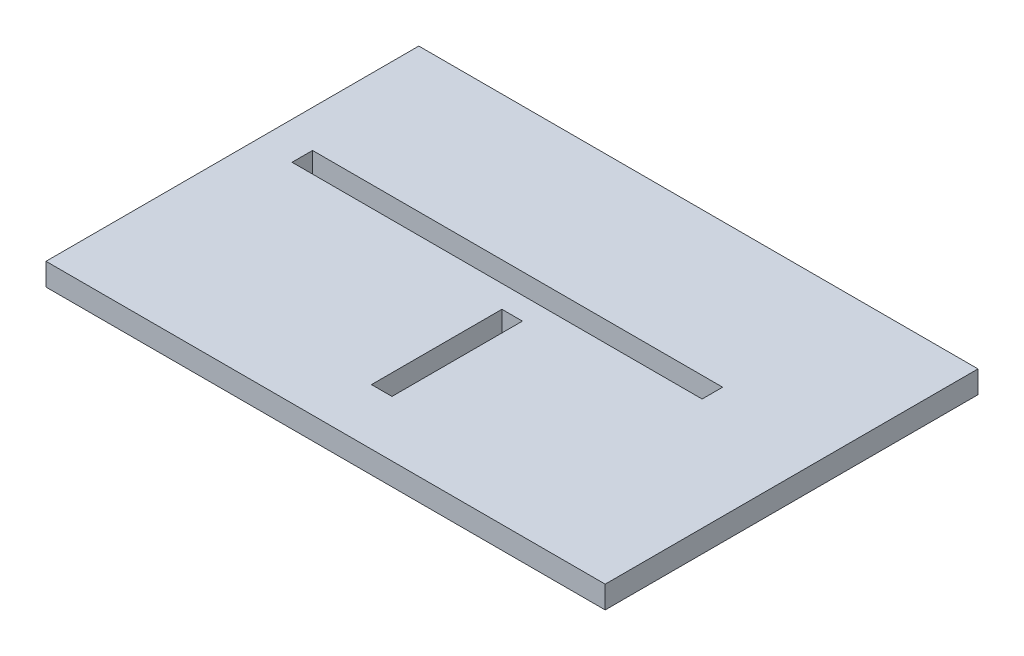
from build123d import *

# Parameters (mm, degrees)
SKETCH1_W           = 150
SKETCH1_H           = 100
SKETCH1_W_2         = 5.5
SKETCH1_H_2         = 35
SKETCH1_W_3         = 110
SKETCH1_H_3         = 5.5
BOSS_EXTRUDE1_DEPTH = 6


with BuildPart() as part:
    # Sketch1 → Boss-Extrude1 (new body)
    with BuildSketch(Plane(origin=(0, 0, 0), x_dir=(1, 0, 0), z_dir=(0, 1, 0))):
        Rectangle(SKETCH1_W, SKETCH1_H)
        with Locations((0.05, -17.5)):
            Rectangle(SKETCH1_W_2, SKETCH1_H_2, mode=Mode.SUBTRACT)
        with Locations((-10, 8.75)):
            Rectangle(SKETCH1_W_3, SKETCH1_H_3, mode=Mode.SUBTRACT)
    extrude(amount=BOSS_EXTRUDE1_DEPTH)


solid = part.part
